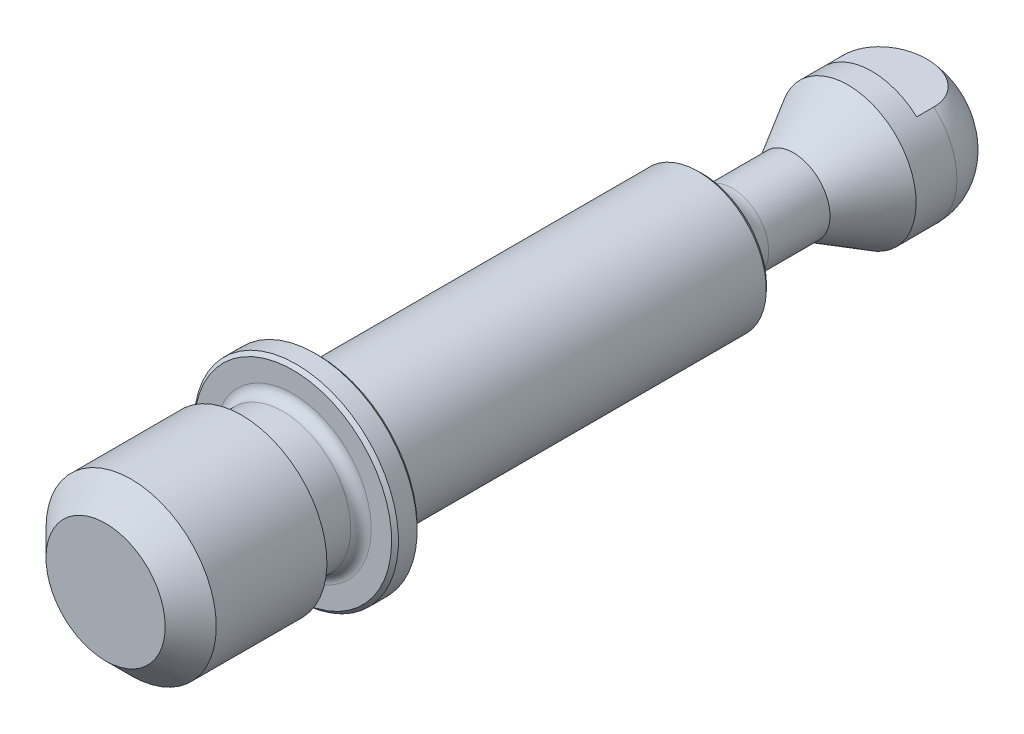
ISO-10303-21;
HEADER;
FILE_DESCRIPTION(('STEP AP214'),'2;1');
FILE_NAME('part.step','',(''),(''),'','','');
FILE_SCHEMA(('AUTOMOTIVE_DESIGN { 1 0 10303 214 1 1 1 1 }'));
ENDSEC;
DATA;
#1=APPLICATION_CONTEXT('core data for automotive mechanical design processes');
#2=APPLICATION_PROTOCOL_DEFINITION('international standard','automotive_design',2000,#1);
#3=PRODUCT_CONTEXT('',#1,'mechanical');
#4=PRODUCT('Part','Part','',(#3));
#5=PRODUCT_RELATED_PRODUCT_CATEGORY('part','',(#4));
#6=PRODUCT_DEFINITION_FORMATION('','',#4);
#7=PRODUCT_DEFINITION_CONTEXT('part definition',#1,'design');
#8=PRODUCT_DEFINITION('design','',#6,#7);
#9=PRODUCT_DEFINITION_SHAPE('','',#8);
#10=(LENGTH_UNIT() NAMED_UNIT(*) SI_UNIT(.MILLI.,.METRE.));
#11=(NAMED_UNIT(*) PLANE_ANGLE_UNIT() SI_UNIT($,.RADIAN.));
#12=(NAMED_UNIT(*) SI_UNIT($,.STERADIAN.) SOLID_ANGLE_UNIT());
#13=UNCERTAINTY_MEASURE_WITH_UNIT(LENGTH_MEASURE(1.E-05),#10,'distance_accuracy_value','');
#14=(GEOMETRIC_REPRESENTATION_CONTEXT(3) GLOBAL_UNCERTAINTY_ASSIGNED_CONTEXT((#13)) GLOBAL_UNIT_ASSIGNED_CONTEXT((#10,
#11,#12)) REPRESENTATION_CONTEXT('',''));
#15=CARTESIAN_POINT('',(0.,0.,0.));
#16=DIRECTION('',(0.,0.,1.));
#17=DIRECTION('',(1.,0.,0.));
#18=AXIS2_PLACEMENT_3D('',#15,#16,#17);
#19=CARTESIAN_POINT('',(0.,0.,0.));
#20=DIRECTION('',(0.,0.,1.));
#21=DIRECTION('',(0.,1.,0.));
#22=AXIS2_PLACEMENT_3D('',#19,#20,#21);
#23=CYLINDRICAL_SURFACE('',#22,6.);
#24=CARTESIAN_POINT('',(0.,0.,-0.2));
#25=DIRECTION('',(0.,0.,-1.));
#26=DIRECTION('',(0.,-1.,0.));
#27=AXIS2_PLACEMENT_3D('',#24,#25,#26);
#28=CIRCLE('',#27,6.);
#29=CARTESIAN_POINT('',(0.,-6.,-0.2));
#30=VERTEX_POINT('',#29);
#31=EDGE_CURVE('E22',#30,#30,#28,.T.);
#32=ORIENTED_EDGE('',*,*,#31,.T.);
#33=EDGE_LOOP('',(#32));
#34=FACE_BOUND('',#33,.T.);
#35=CARTESIAN_POINT('',(0.,0.,-1.3));
#36=DIRECTION('',(0.,0.,1.));
#37=DIRECTION('',(0.,1.,0.));
#38=AXIS2_PLACEMENT_3D('',#35,#36,#37);
#39=CIRCLE('',#38,6.);
#40=CARTESIAN_POINT('',(0.,6.,-1.3));
#41=VERTEX_POINT('',#40);
#42=EDGE_CURVE('E225',#41,#41,#39,.T.);
#43=ORIENTED_EDGE('',*,*,#42,.T.);
#44=EDGE_LOOP('',(#43));
#45=FACE_BOUND('',#44,.T.);
#46=ADVANCED_FACE('F14',(#34,#45),#23,.T.);
#47=CARTESIAN_POINT('',(-6.,0.,-1.5));
#48=DIRECTION('',(0.,0.,1.));
#49=DIRECTION('',(0.,1.,0.));
#50=AXIS2_PLACEMENT_3D('',#47,#48,#49);
#51=PLANE('',#50);
#52=CARTESIAN_POINT('',(0.,0.,-1.5));
#53=DIRECTION('',(0.,0.,1.));
#54=DIRECTION('',(0.,1.,0.));
#55=AXIS2_PLACEMENT_3D('',#52,#53,#54);
#56=CIRCLE('',#55,5.8);
#57=CARTESIAN_POINT('',(0.,5.8,-1.5));
#58=VERTEX_POINT('',#57);
#59=EDGE_CURVE('E9',#58,#58,#56,.F.);
#60=ORIENTED_EDGE('',*,*,#59,.T.);
#61=EDGE_LOOP('',(#60));
#62=FACE_BOUND('',#61,.T.);
#63=CARTESIAN_POINT('',(0.,0.,-1.5));
#64=DIRECTION('',(0.,0.,1.));
#65=DIRECTION('',(0.,1.,0.));
#66=AXIS2_PLACEMENT_3D('',#63,#64,#65);
#67=CIRCLE('',#66,4.4);
#68=CARTESIAN_POINT('',(0.,4.4,-1.5));
#69=VERTEX_POINT('',#68);
#70=EDGE_CURVE('E110',#69,#69,#67,.T.);
#71=ORIENTED_EDGE('',*,*,#70,.T.);
#72=EDGE_LOOP('',(#71));
#73=FACE_BOUND('',#72,.T.);
#74=ADVANCED_FACE('F182',(#62,#73),#51,.F.);
#75=CARTESIAN_POINT('',(0.,0.,0.));
#76=DIRECTION('',(0.,0.,1.));
#77=DIRECTION('',(0.,1.,0.));
#78=AXIS2_PLACEMENT_3D('',#75,#76,#77);
#79=CYLINDRICAL_SURFACE('',#78,4.);
#80=CARTESIAN_POINT('',(0.,0.,-23.8056329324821));
#81=DIRECTION('',(0.,0.,1.));
#82=DIRECTION('',(0.,1.,0.));
#83=AXIS2_PLACEMENT_3D('',#80,#81,#82);
#84=CIRCLE('',#83,4.);
#85=CARTESIAN_POINT('',(0.,4.,-23.8056329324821));
#86=VERTEX_POINT('',#85);
#87=EDGE_CURVE('E61',#86,#86,#84,.T.);
#88=ORIENTED_EDGE('',*,*,#87,.T.);
#89=EDGE_LOOP('',(#88));
#90=FACE_BOUND('',#89,.T.);
#91=CARTESIAN_POINT('',(0.,0.,-1.9));
#92=DIRECTION('',(0.,0.,1.));
#93=DIRECTION('',(0.,1.,0.));
#94=AXIS2_PLACEMENT_3D('',#91,#92,#93);
#95=CIRCLE('',#94,4.);
#96=CARTESIAN_POINT('',(0.,4.,-1.9));
#97=VERTEX_POINT('',#96);
#98=EDGE_CURVE('E113',#97,#97,#95,.F.);
#99=ORIENTED_EDGE('',*,*,#98,.T.);
#100=EDGE_LOOP('',(#99));
#101=FACE_BOUND('',#100,.T.);
#102=ADVANCED_FACE('F178',(#90,#101),#79,.T.);
#103=CARTESIAN_POINT('',(0.,0.,0.));
#104=DIRECTION('',(0.,0.,1.));
#105=DIRECTION('',(0.,1.,0.));
#106=AXIS2_PLACEMENT_3D('',#103,#104,#105);
#107=CYLINDRICAL_SURFACE('',#106,2.15);
#108=CARTESIAN_POINT('',(0.,0.,-25.8));
#109=DIRECTION('',(0.,0.,1.));
#110=DIRECTION('',(0.,1.,0.));
#111=AXIS2_PLACEMENT_3D('',#108,#109,#110);
#112=CIRCLE('',#111,2.15);
#113=CARTESIAN_POINT('',(0.,2.15,-25.8));
#114=VERTEX_POINT('',#113);
#115=EDGE_CURVE('E116',#114,#114,#112,.F.);
#116=ORIENTED_EDGE('',*,*,#115,.T.);
#117=EDGE_LOOP('',(#116));
#118=FACE_BOUND('',#117,.T.);
#119=CARTESIAN_POINT('',(0.,0.,-29.4));
#120=DIRECTION('',(0.,0.,1.));
#121=DIRECTION('',(0.,1.,0.));
#122=AXIS2_PLACEMENT_3D('',#119,#120,#121);
#123=CIRCLE('',#122,2.15);
#124=CARTESIAN_POINT('',(0.,2.15,-29.4));
#125=VERTEX_POINT('',#124);
#126=EDGE_CURVE('E89',#125,#125,#123,.T.);
#127=ORIENTED_EDGE('',*,*,#126,.T.);
#128=EDGE_LOOP('',(#127));
#129=FACE_BOUND('',#128,.T.);
#130=ADVANCED_FACE('F174',(#118,#129),#107,.T.);
#131=CARTESIAN_POINT('',(0.,0.,-32.6042939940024));
#132=DIRECTION('',(0.,0.,-1.));
#133=DIRECTION('',(0.,-1.,0.));
#134=AXIS2_PLACEMENT_3D('',#131,#132,#133);
#135=CONICAL_SURFACE('',#134,4.,0.523598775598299);
#136=ORIENTED_EDGE('',*,*,#126,.F.);
#137=EDGE_LOOP('',(#136));
#138=FACE_BOUND('',#137,.T.);
#139=CARTESIAN_POINT('',(0.,0.,-32.6042939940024));
#140=DIRECTION('',(0.,0.,1.));
#141=DIRECTION('',(0.,1.,0.));
#142=AXIS2_PLACEMENT_3D('',#139,#140,#141);
#143=CIRCLE('',#142,4.);
#144=CARTESIAN_POINT('',(0.,4.,-32.6042939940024));
#145=VERTEX_POINT('',#144);
#146=EDGE_CURVE('E86',#145,#145,#143,.T.);
#147=ORIENTED_EDGE('',*,*,#146,.T.);
#148=EDGE_LOOP('',(#147));
#149=FACE_BOUND('',#148,.T.);
#150=ADVANCED_FACE('F171',(#138,#149),#135,.T.);
#151=CARTESIAN_POINT('',(0.,0.,0.));
#152=DIRECTION('',(0.,0.,1.));
#153=DIRECTION('',(0.,1.,0.));
#154=AXIS2_PLACEMENT_3D('',#151,#152,#153);
#155=CYLINDRICAL_SURFACE('',#154,4.);
#156=CARTESIAN_POINT('',(0.,0.,-35.));
#157=DIRECTION('',(0.,0.,1.));
#158=DIRECTION('',(0.,1.,0.));
#159=AXIS2_PLACEMENT_3D('',#156,#157,#158);
#160=CIRCLE('',#159,4.);
#161=CARTESIAN_POINT('',(-2.6457513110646,3.,-35.));
#162=VERTEX_POINT('',#161);
#163=CARTESIAN_POINT('',(-2.6457513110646,-3.,-35.));
#164=VERTEX_POINT('',#163);
#165=EDGE_CURVE('E72',#162,#164,#160,.T.);
#166=ORIENTED_EDGE('',*,*,#165,.T.);
#167=DIRECTION('',(0.,0.,1.));
#168=VECTOR('',#167,1.);
#169=CARTESIAN_POINT('',(-2.6457513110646,-3.,0.));
#170=LINE('',#169,#168);
#171=CARTESIAN_POINT('',(-2.6457513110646,-3.,-34.));
#172=VERTEX_POINT('',#171);
#173=EDGE_CURVE('E29',#164,#172,#170,.T.);
#174=ORIENTED_EDGE('',*,*,#173,.T.);
#175=CARTESIAN_POINT('',(0.,0.,-34.));
#176=DIRECTION('',(0.,0.,-1.));
#177=DIRECTION('',(0.,-1.,0.));
#178=AXIS2_PLACEMENT_3D('',#175,#176,#177);
#179=CIRCLE('',#178,4.);
#180=CARTESIAN_POINT('',(2.6457513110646,-3.,-34.));
#181=VERTEX_POINT('',#180);
#182=EDGE_CURVE('E58',#181,#172,#179,.T.);
#183=ORIENTED_EDGE('',*,*,#182,.F.);
#184=DIRECTION('',(0.,0.,1.));
#185=VECTOR('',#184,1.);
#186=CARTESIAN_POINT('',(2.6457513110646,-3.,0.));
#187=LINE('',#186,#185);
#188=CARTESIAN_POINT('',(2.6457513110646,-3.,-35.));
#189=VERTEX_POINT('',#188);
#190=EDGE_CURVE('E65',#181,#189,#187,.F.);
#191=ORIENTED_EDGE('',*,*,#190,.T.);
#192=CARTESIAN_POINT('',(2.6457513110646,3.,-35.));
#193=VERTEX_POINT('',#192);
#194=EDGE_CURVE('E37',#189,#193,#160,.T.);
#195=ORIENTED_EDGE('',*,*,#194,.T.);
#196=DIRECTION('',(0.,0.,1.));
#197=VECTOR('',#196,1.);
#198=CARTESIAN_POINT('',(2.6457513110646,3.,0.));
#199=LINE('',#198,#197);
#200=CARTESIAN_POINT('',(2.6457513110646,3.,-34.));
#201=VERTEX_POINT('',#200);
#202=EDGE_CURVE('E81',#193,#201,#199,.T.);
#203=ORIENTED_EDGE('',*,*,#202,.T.);
#204=CARTESIAN_POINT('',(0.,0.,-34.));
#205=DIRECTION('',(0.,0.,-1.));
#206=DIRECTION('',(0.,-1.,0.));
#207=AXIS2_PLACEMENT_3D('',#204,#205,#206);
#208=CIRCLE('',#207,4.);
#209=CARTESIAN_POINT('',(-2.6457513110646,3.,-34.));
#210=VERTEX_POINT('',#209);
#211=EDGE_CURVE('E130',#210,#201,#208,.T.);
#212=ORIENTED_EDGE('',*,*,#211,.F.);
#213=DIRECTION('',(0.,0.,1.));
#214=VECTOR('',#213,1.);
#215=CARTESIAN_POINT('',(-2.6457513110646,3.,0.));
#216=LINE('',#215,#214);
#217=EDGE_CURVE('E76',#210,#162,#216,.F.);
#218=ORIENTED_EDGE('',*,*,#217,.T.);
#219=EDGE_LOOP('',(#166,#174,#183,#191,#195,#203,#212,#218));
#220=FACE_BOUND('',#219,.T.);
#221=ORIENTED_EDGE('',*,*,#146,.F.);
#222=EDGE_LOOP('',(#221));
#223=FACE_BOUND('',#222,.T.);
#224=ADVANCED_FACE('F68',(#220,#223),#155,.T.);
#225=CARTESIAN_POINT('',(0.,0.,-38.));
#226=DIRECTION('',(0.,0.,1.));
#227=DIRECTION('',(0.,1.,0.));
#228=AXIS2_PLACEMENT_3D('',#225,#226,#227);
#229=PLANE('',#228);
#230=CARTESIAN_POINT('',(0.,0.,-38.));
#231=DIRECTION('',(0.,0.,1.));
#232=DIRECTION('',(0.,1.,0.));
#233=AXIS2_PLACEMENT_3D('',#230,#231,#232);
#234=CIRCLE('',#233,1.);
#235=CARTESIAN_POINT('',(0.,1.,-38.));
#236=VERTEX_POINT('',#235);
#237=EDGE_CURVE('E120',#236,#236,#234,.F.);
#238=ORIENTED_EDGE('',*,*,#237,.T.);
#239=EDGE_LOOP('',(#238));
#240=FACE_BOUND('',#239,.T.);
#241=ADVANCED_FACE('F164',(#240),#229,.F.);
#242=CARTESIAN_POINT('',(-5.,0.,11.));
#243=DIRECTION('',(0.,0.,-1.));
#244=DIRECTION('',(0.,-1.,0.));
#245=AXIS2_PLACEMENT_3D('',#242,#243,#244);
#246=PLANE('',#245);
#247=CARTESIAN_POINT('',(0.,0.,11.));
#248=DIRECTION('',(0.,0.,-1.));
#249=DIRECTION('',(0.,-1.,0.));
#250=AXIS2_PLACEMENT_3D('',#247,#248,#249);
#251=CIRCLE('',#250,3.5);
#252=CARTESIAN_POINT('',(0.,-3.5,11.));
#253=VERTEX_POINT('',#252);
#254=EDGE_CURVE('E92',#253,#253,#251,.F.);
#255=ORIENTED_EDGE('',*,*,#254,.T.);
#256=EDGE_LOOP('',(#255));
#257=FACE_BOUND('',#256,.T.);
#258=ADVANCED_FACE('F160',(#257),#246,.F.);
#259=CARTESIAN_POINT('',(0.,0.,0.));
#260=DIRECTION('',(0.,0.,1.));
#261=DIRECTION('',(0.,1.,0.));
#262=AXIS2_PLACEMENT_3D('',#259,#260,#261);
#263=CYLINDRICAL_SURFACE('',#262,5.);
#264=CARTESIAN_POINT('',(0.,0.,9.5));
#265=DIRECTION('',(0.,0.,-1.));
#266=DIRECTION('',(0.,-1.,0.));
#267=AXIS2_PLACEMENT_3D('',#264,#265,#266);
#268=CIRCLE('',#267,5.);
#269=CARTESIAN_POINT('',(0.,-5.,9.5));
#270=VERTEX_POINT('',#269);
#271=EDGE_CURVE('E95',#270,#270,#268,.T.);
#272=ORIENTED_EDGE('',*,*,#271,.T.);
#273=EDGE_LOOP('',(#272));
#274=FACE_BOUND('',#273,.T.);
#275=CARTESIAN_POINT('',(0.,0.,3.));
#276=DIRECTION('',(0.,0.,1.));
#277=DIRECTION('',(0.,1.,0.));
#278=AXIS2_PLACEMENT_3D('',#275,#276,#277);
#279=CIRCLE('',#278,5.);
#280=CARTESIAN_POINT('',(0.,5.,3.));
#281=VERTEX_POINT('',#280);
#282=EDGE_CURVE('E83',#281,#281,#279,.T.);
#283=ORIENTED_EDGE('',*,*,#282,.T.);
#284=EDGE_LOOP('',(#283));
#285=FACE_BOUND('',#284,.T.);
#286=ADVANCED_FACE('F156',(#274,#285),#263,.T.);
#287=CARTESIAN_POINT('',(-4.,0.,3.));
#288=DIRECTION('',(0.,0.,1.));
#289=DIRECTION('',(0.,1.,0.));
#290=AXIS2_PLACEMENT_3D('',#287,#288,#289);
#291=PLANE('',#290);
#292=CARTESIAN_POINT('',(0.,0.,3.));
#293=DIRECTION('',(0.,0.,1.));
#294=DIRECTION('',(0.,1.,0.));
#295=AXIS2_PLACEMENT_3D('',#292,#293,#294);
#296=CIRCLE('',#295,4.6);
#297=CARTESIAN_POINT('',(0.,4.6,3.));
#298=VERTEX_POINT('',#297);
#299=EDGE_CURVE('E98',#298,#298,#296,.T.);
#300=ORIENTED_EDGE('',*,*,#299,.T.);
#301=EDGE_LOOP('',(#300));
#302=FACE_BOUND('',#301,.T.);
#303=ORIENTED_EDGE('',*,*,#282,.F.);
#304=EDGE_LOOP('',(#303));
#305=FACE_BOUND('',#304,.T.);
#306=ADVANCED_FACE('F152',(#302,#305),#291,.F.);
#307=CARTESIAN_POINT('',(0.,0.,0.));
#308=DIRECTION('',(0.,0.,1.));
#309=DIRECTION('',(0.,1.,0.));
#310=AXIS2_PLACEMENT_3D('',#307,#308,#309);
#311=CYLINDRICAL_SURFACE('',#310,4.);
#312=CARTESIAN_POINT('',(0.,0.,2.4));
#313=DIRECTION('',(0.,0.,1.));
#314=DIRECTION('',(0.,1.,0.));
#315=AXIS2_PLACEMENT_3D('',#312,#313,#314);
#316=CIRCLE('',#315,4.);
#317=CARTESIAN_POINT('',(0.,4.,2.4));
#318=VERTEX_POINT('',#317);
#319=EDGE_CURVE('E104',#318,#318,#316,.F.);
#320=ORIENTED_EDGE('',*,*,#319,.T.);
#321=EDGE_LOOP('',(#320));
#322=FACE_BOUND('',#321,.T.);
#323=CARTESIAN_POINT('',(0.,0.,0.6));
#324=DIRECTION('',(0.,0.,-1.));
#325=DIRECTION('',(0.,-1.,0.));
#326=AXIS2_PLACEMENT_3D('',#323,#324,#325);
#327=CIRCLE('',#326,4.);
#328=CARTESIAN_POINT('',(0.,-4.,0.6));
#329=VERTEX_POINT('',#328);
#330=EDGE_CURVE('E101',#329,#329,#327,.F.);
#331=ORIENTED_EDGE('',*,*,#330,.T.);
#332=EDGE_LOOP('',(#331));
#333=FACE_BOUND('',#332,.T.);
#334=ADVANCED_FACE('F148',(#322,#333),#311,.T.);
#335=CARTESIAN_POINT('',(-4.,0.,0.));
#336=DIRECTION('',(0.,0.,-1.));
#337=DIRECTION('',(0.,-1.,0.));
#338=AXIS2_PLACEMENT_3D('',#335,#336,#337);
#339=PLANE('',#338);
#340=CARTESIAN_POINT('',(0.,0.,0.));
#341=DIRECTION('',(0.,0.,-1.));
#342=DIRECTION('',(0.,-1.,0.));
#343=AXIS2_PLACEMENT_3D('',#340,#341,#342);
#344=CIRCLE('',#343,5.8);
#345=CARTESIAN_POINT('',(0.,-5.8,0.));
#346=VERTEX_POINT('',#345);
#347=EDGE_CURVE('E222',#346,#346,#344,.F.);
#348=ORIENTED_EDGE('',*,*,#347,.T.);
#349=EDGE_LOOP('',(#348));
#350=FACE_BOUND('',#349,.T.);
#351=CARTESIAN_POINT('',(0.,0.,0.));
#352=DIRECTION('',(0.,0.,-1.));
#353=DIRECTION('',(0.,-1.,0.));
#354=AXIS2_PLACEMENT_3D('',#351,#352,#353);
#355=CIRCLE('',#354,4.6);
#356=CARTESIAN_POINT('',(0.,-4.6,0.));
#357=VERTEX_POINT('',#356);
#358=EDGE_CURVE('E107',#357,#357,#355,.T.);
#359=ORIENTED_EDGE('',*,*,#358,.T.);
#360=EDGE_LOOP('',(#359));
#361=FACE_BOUND('',#360,.T.);
#362=ADVANCED_FACE('F144',(#350,#361),#339,.F.);
#363=CARTESIAN_POINT('',(0.,0.,11.));
#364=DIRECTION('',(0.,0.,-1.));
#365=DIRECTION('',(0.,-1.,0.));
#366=AXIS2_PLACEMENT_3D('',#363,#364,#365);
#367=CONICAL_SURFACE('',#366,3.5,0.785398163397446);
#368=ORIENTED_EDGE('',*,*,#271,.F.);
#369=EDGE_LOOP('',(#368));
#370=FACE_BOUND('',#369,.T.);
#371=ORIENTED_EDGE('',*,*,#254,.F.);
#372=EDGE_LOOP('',(#371));
#373=FACE_BOUND('',#372,.T.);
#374=ADVANCED_FACE('F147',(#370,#373),#367,.T.);
#375=CARTESIAN_POINT('',(0.,0.,2.4));
#376=DIRECTION('',(0.,0.,1.));
#377=DIRECTION('',(0.,1.,0.));
#378=AXIS2_PLACEMENT_3D('',#375,#376,#377);
#379=TOROIDAL_SURFACE('',#378,4.6,0.6);
#380=ORIENTED_EDGE('',*,*,#319,.F.);
#381=EDGE_LOOP('',(#380));
#382=FACE_BOUND('',#381,.T.);
#383=ORIENTED_EDGE('',*,*,#299,.F.);
#384=EDGE_LOOP('',(#383));
#385=FACE_BOUND('',#384,.T.);
#386=ADVANCED_FACE('F192',(#382,#385),#379,.F.);
#387=CARTESIAN_POINT('',(0.,0.,0.6));
#388=DIRECTION('',(0.,0.,-1.));
#389=DIRECTION('',(0.,-1.,0.));
#390=AXIS2_PLACEMENT_3D('',#387,#388,#389);
#391=TOROIDAL_SURFACE('',#390,4.6,0.6);
#392=ORIENTED_EDGE('',*,*,#358,.F.);
#393=EDGE_LOOP('',(#392));
#394=FACE_BOUND('',#393,.T.);
#395=ORIENTED_EDGE('',*,*,#330,.F.);
#396=EDGE_LOOP('',(#395));
#397=FACE_BOUND('',#396,.T.);
#398=ADVANCED_FACE('F196',(#394,#397),#391,.F.);
#399=CARTESIAN_POINT('',(0.,0.,-1.9));
#400=DIRECTION('',(0.,0.,1.));
#401=DIRECTION('',(0.,1.,0.));
#402=AXIS2_PLACEMENT_3D('',#399,#400,#401);
#403=TOROIDAL_SURFACE('',#402,4.4,0.4);
#404=ORIENTED_EDGE('',*,*,#98,.F.);
#405=EDGE_LOOP('',(#404));
#406=FACE_BOUND('',#405,.T.);
#407=ORIENTED_EDGE('',*,*,#70,.F.);
#408=EDGE_LOOP('',(#407));
#409=FACE_BOUND('',#408,.T.);
#410=ADVANCED_FACE('F200',(#406,#409),#403,.F.);
#411=CARTESIAN_POINT('',(0.,0.,-25.8));
#412=DIRECTION('',(0.,0.,1.));
#413=DIRECTION('',(0.,1.,0.));
#414=AXIS2_PLACEMENT_3D('',#411,#412,#413);
#415=TOROIDAL_SURFACE('',#414,3.95,1.8);
#416=CARTESIAN_POINT('',(0.,0.,-24.0050696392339));
#417=DIRECTION('',(0.,0.,-1.));
#418=DIRECTION('',(0.,-1.,0.));
#419=AXIS2_PLACEMENT_3D('',#416,#417,#418);
#420=CIRCLE('',#419,3.815);
#421=CARTESIAN_POINT('',(0.,-3.815,-24.0050696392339));
#422=VERTEX_POINT('',#421);
#423=EDGE_CURVE('E215',#422,#422,#420,.T.);
#424=ORIENTED_EDGE('',*,*,#423,.T.);
#425=EDGE_LOOP('',(#424));
#426=FACE_BOUND('',#425,.T.);
#427=ORIENTED_EDGE('',*,*,#115,.F.);
#428=EDGE_LOOP('',(#427));
#429=FACE_BOUND('',#428,.T.);
#430=ADVANCED_FACE('F203',(#426,#429),#415,.F.);
#431=CARTESIAN_POINT('',(0.,0.,-35.));
#432=DIRECTION('',(0.,0.,1.));
#433=DIRECTION('',(0.,1.,0.));
#434=AXIS2_PLACEMENT_3D('',#431,#432,#433);
#435=DEGENERATE_TOROIDAL_SURFACE('',#434,1.,3.,.T.);
#436=CARTESIAN_POINT('',(0.,-3.,-37.2360679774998));
#437=CARTESIAN_POINT('',(0.182130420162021,-3.,-37.2360730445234));
#438=CARTESIAN_POINT('',(0.364315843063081,-3.,-37.2213187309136));
#439=CARTESIAN_POINT('',(0.723592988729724,-3.,-37.1613493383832));
#440=CARTESIAN_POINT('',(0.900689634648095,-3.,-37.1161648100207));
#441=CARTESIAN_POINT('',(1.20801765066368,-3.,-37.0061514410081));
#442=CARTESIAN_POINT('',(1.3403812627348,-3.,-36.9472966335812));
#443=CARTESIAN_POINT('',(1.59371415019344,-3.,-36.8086382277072));
#444=CARTESIAN_POINT('',(1.71469026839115,-3.,-36.7288473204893));
#445=CARTESIAN_POINT('',(1.94131475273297,-3.,-36.548058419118));
#446=CARTESIAN_POINT('',(2.04683753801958,-3.,-36.4469014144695));
#447=CARTESIAN_POINT('',(2.23610882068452,-3.,-36.2258543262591));
#448=CARTESIAN_POINT('',(2.31987165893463,-3.,-36.1059766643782));
#449=CARTESIAN_POINT('',(2.45137620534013,-3.,-35.8685696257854));
#450=CARTESIAN_POINT('',(2.50243931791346,-3.,-35.7528750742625));
#451=CARTESIAN_POINT('',(2.58222641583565,-3.,-35.5140328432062));
#452=CARTESIAN_POINT('',(2.61096503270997,-3.,-35.3908901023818));
#453=CARTESIAN_POINT('',(2.64317885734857,-3.,-35.1526642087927));
#454=CARTESIAN_POINT('',(2.64869439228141,-3.,-35.0378527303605));
#455=CARTESIAN_POINT('',(2.6398528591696,-3.,-34.8090131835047));
#456=CARTESIAN_POINT('',(2.62550060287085,-3.,-34.6949849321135));
#457=CARTESIAN_POINT('',(2.57811323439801,-3.,-34.4737675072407));
#458=CARTESIAN_POINT('',(2.54553396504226,-3.,-34.366479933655));
#459=CARTESIAN_POINT('',(2.4633087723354,-3.,-34.158681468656));
#460=CARTESIAN_POINT('',(2.41366206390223,-3.,-34.0581708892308));
#461=CARTESIAN_POINT('',(2.29748673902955,-3.,-33.8635303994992));
#462=CARTESIAN_POINT('',(2.23051545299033,-3.,-33.769665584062));
#463=CARTESIAN_POINT('',(2.08284770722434,-3.,-33.5934794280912));
#464=CARTESIAN_POINT('',(2.00214781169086,-3.,-33.5111609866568));
#465=CARTESIAN_POINT('',(1.82264615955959,-3.,-33.3531312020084));
#466=CARTESIAN_POINT('',(1.72291044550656,-3.,-33.2784840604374));
#467=CARTESIAN_POINT('',(1.51360451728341,-3.,-33.1446444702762));
#468=CARTESIAN_POINT('',(1.40403016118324,-3.,-33.0854585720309));
#469=CARTESIAN_POINT('',(1.16220414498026,-3.,-32.9752876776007));
#470=CARTESIAN_POINT('',(1.02891680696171,-3.,-32.9265841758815));
#471=CARTESIAN_POINT('',(0.756854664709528,-3.,-32.8483168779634));
#472=CARTESIAN_POINT('',(0.61807602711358,-3.,-32.8187667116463));
#473=CARTESIAN_POINT('',(0.311732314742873,-3.,-32.7741468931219));
#474=CARTESIAN_POINT('',(0.143620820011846,-3.,-32.7628003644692));
#475=CARTESIAN_POINT('',(-0.192610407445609,-3.,-32.7652425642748));
#476=CARTESIAN_POINT('',(-0.360729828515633,-3.,-32.7790661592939));
#477=CARTESIAN_POINT('',(-0.711775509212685,-3.,-32.8356870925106));
#478=CARTESIAN_POINT('',(-0.894221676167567,-3.,-32.8815892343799));
#479=CARTESIAN_POINT('',(-1.2467838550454,-3.,-33.0076571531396));
#480=CARTESIAN_POINT('',(-1.41692949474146,-3.,-33.0877371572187));
#481=CARTESIAN_POINT('',(-1.68782709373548,-3.,-33.253590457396));
#482=CARTESIAN_POINT('',(-1.79407437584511,-3.,-33.3304326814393));
#483=CARTESIAN_POINT('',(-1.99244199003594,-3.,-33.5006681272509));
#484=CARTESIAN_POINT('',(-2.08456939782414,-3.,-33.5940530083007));
#485=CARTESIAN_POINT('',(-2.25136410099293,-3.,-33.796238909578));
#486=CARTESIAN_POINT('',(-2.32593419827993,-3.,-33.9051206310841));
#487=CARTESIAN_POINT('',(-2.45340856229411,-3.,-34.1349484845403));
#488=CARTESIAN_POINT('',(-2.50632050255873,-3.,-34.2558903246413));
#489=CARTESIAN_POINT('',(-2.58380733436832,-3.,-34.4936035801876));
#490=CARTESIAN_POINT('',(-2.61062950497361,-3.,-34.6096453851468));
#491=CARTESIAN_POINT('',(-2.64319909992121,-3.,-34.8446356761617));
#492=CARTESIAN_POINT('',(-2.648955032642,-3.,-34.9635829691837));
#493=CARTESIAN_POINT('',(-2.6394119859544,-3.,-35.1942716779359));
#494=CARTESIAN_POINT('',(-2.6252141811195,-3.,-35.3060605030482));
#495=CARTESIAN_POINT('',(-2.57829739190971,-3.,-35.525661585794));
#496=CARTESIAN_POINT('',(-2.54557999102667,-3.,-35.63347418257));
#497=CARTESIAN_POINT('',(-2.46277618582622,-3.,-35.8425934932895));
#498=CARTESIAN_POINT('',(-2.41263246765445,-3.,-35.9438774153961));
#499=CARTESIAN_POINT('',(-2.29688023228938,-3.,-36.1371530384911));
#500=CARTESIAN_POINT('',(-2.23126933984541,-3.,-36.229143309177));
#501=CARTESIAN_POINT('',(-2.08293087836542,-3.,-36.4067191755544));
#502=CARTESIAN_POINT('',(-1.99947023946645,-3.,-36.4916905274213));
#503=CARTESIAN_POINT('',(-1.82071046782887,-3.,-36.6480453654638));
#504=CARTESIAN_POINT('',(-1.72540724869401,-3.,-36.7194241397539));
#505=CARTESIAN_POINT('',(-1.51485660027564,-3.,-36.8550675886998));
#506=CARTESIAN_POINT('',(-1.39856751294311,-3.,-36.9177097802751));
#507=CARTESIAN_POINT('',(-1.15828317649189,-3.,-37.0257432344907));
#508=CARTESIAN_POINT('',(-1.03428427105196,-3.,-37.0711262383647));
#509=CARTESIAN_POINT('',(-0.760833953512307,-3.,-37.1513162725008));
#510=CARTESIAN_POINT('',(-0.610526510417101,-3.,-37.1831966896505));
#511=CARTESIAN_POINT('',(-0.306828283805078,-3.,-37.2255846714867));
#512=CARTESIAN_POINT('',(-0.153433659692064,-3.,-37.2360637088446));
#513=CARTESIAN_POINT('',(0.,-3.,-37.2360679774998));
#514=B_SPLINE_CURVE_WITH_KNOTS('',3,(#436,#437,#438,#439,#440,#441,#442,#443,#444,#445,#446,
#447,#448,#449,#450,#451,#452,#453,#454,#455,#456,#457,#458,#459,#460,#461,#462,#463,#464,#465,
#466,#467,#468,#469,#470,#471,#472,#473,#474,#475,#476,#477,#478,#479,#480,#481,#482,#483,#484,
#485,#486,#487,#488,#489,#490,#491,#492,#493,#494,#495,#496,#497,#498,#499,#500,#501,#502,#503,
#504,#505,#506,#507,#508,#509,#510,#511,#512,#513),.UNSPECIFIED.,.T.,.F.,(4,2,2,2,2,2,2,2,2,2,2,
2,2,2,2,2,2,2,2,2,2,2,2,2,2,2,2,2,2,2,2,2,2,2,2,2,2,2,4),(0.,0.545881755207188,1.09121628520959,
1.52407148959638,1.95666490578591,2.39259896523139,2.82824498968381,3.20555876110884,
3.58262503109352,3.9257665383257,4.2688249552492,4.60366436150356,4.93851917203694,
5.28296170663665,5.62749057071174,5.99973468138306,6.37213624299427,6.79627198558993,
7.22070922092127,7.72421554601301,8.22841987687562,8.78974139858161,9.34966243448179,
9.74144173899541,10.1330240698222,10.5267257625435,10.9202878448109,11.2757520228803,
11.6310726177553,11.9675363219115,12.3039712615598,12.6415233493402,12.9791273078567,
13.3349649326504,13.6909256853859,14.0856703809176,14.4806037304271,14.9398637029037,
15.3997354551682),.UNSPECIFIED.);
#515=EDGE_CURVE('E62',#164,#189,#514,.T.);
#516=ORIENTED_EDGE('',*,*,#515,.F.);
#517=ORIENTED_EDGE('',*,*,#165,.F.);
#518=CARTESIAN_POINT('',(0.,3.,-37.2360679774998));
#519=CARTESIAN_POINT('',(-0.182130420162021,3.,-37.2360730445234));
#520=CARTESIAN_POINT('',(-0.364315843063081,3.,-37.2213187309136));
#521=CARTESIAN_POINT('',(-0.723592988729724,3.,-37.1613493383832));
#522=CARTESIAN_POINT('',(-0.900689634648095,3.,-37.1161648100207));
#523=CARTESIAN_POINT('',(-1.20801765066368,3.,-37.0061514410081));
#524=CARTESIAN_POINT('',(-1.3403812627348,3.,-36.9472966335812));
#525=CARTESIAN_POINT('',(-1.59371415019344,3.,-36.8086382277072));
#526=CARTESIAN_POINT('',(-1.71469026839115,3.,-36.7288473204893));
#527=CARTESIAN_POINT('',(-1.94131475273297,3.,-36.548058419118));
#528=CARTESIAN_POINT('',(-2.04683753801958,3.,-36.4469014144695));
#529=CARTESIAN_POINT('',(-2.23610882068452,3.,-36.2258543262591));
#530=CARTESIAN_POINT('',(-2.31987165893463,3.,-36.1059766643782));
#531=CARTESIAN_POINT('',(-2.45137620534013,3.,-35.8685696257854));
#532=CARTESIAN_POINT('',(-2.50243931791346,3.,-35.7528750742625));
#533=CARTESIAN_POINT('',(-2.58222641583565,3.,-35.5140328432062));
#534=CARTESIAN_POINT('',(-2.61096503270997,3.,-35.3908901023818));
#535=CARTESIAN_POINT('',(-2.64317885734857,3.,-35.1526642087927));
#536=CARTESIAN_POINT('',(-2.64869439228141,3.,-35.0378527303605));
#537=CARTESIAN_POINT('',(-2.6398528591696,3.,-34.8090131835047));
#538=CARTESIAN_POINT('',(-2.62550060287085,3.,-34.6949849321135));
#539=CARTESIAN_POINT('',(-2.57811323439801,3.,-34.4737675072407));
#540=CARTESIAN_POINT('',(-2.54553396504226,3.,-34.366479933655));
#541=CARTESIAN_POINT('',(-2.4633087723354,3.,-34.158681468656));
#542=CARTESIAN_POINT('',(-2.41366206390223,3.,-34.0581708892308));
#543=CARTESIAN_POINT('',(-2.29748673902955,3.,-33.8635303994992));
#544=CARTESIAN_POINT('',(-2.23051545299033,3.,-33.769665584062));
#545=CARTESIAN_POINT('',(-2.08284770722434,3.,-33.5934794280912));
#546=CARTESIAN_POINT('',(-2.00214781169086,3.,-33.5111609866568));
#547=CARTESIAN_POINT('',(-1.82264615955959,3.,-33.3531312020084));
#548=CARTESIAN_POINT('',(-1.72291044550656,3.,-33.2784840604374));
#549=CARTESIAN_POINT('',(-1.51360451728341,3.,-33.1446444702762));
#550=CARTESIAN_POINT('',(-1.40403016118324,3.,-33.0854585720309));
#551=CARTESIAN_POINT('',(-1.16220414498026,3.,-32.9752876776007));
#552=CARTESIAN_POINT('',(-1.02891680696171,3.,-32.9265841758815));
#553=CARTESIAN_POINT('',(-0.756854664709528,3.,-32.8483168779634));
#554=CARTESIAN_POINT('',(-0.61807602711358,3.,-32.8187667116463));
#555=CARTESIAN_POINT('',(-0.311732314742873,3.,-32.7741468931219));
#556=CARTESIAN_POINT('',(-0.143620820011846,3.,-32.7628003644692));
#557=CARTESIAN_POINT('',(0.192610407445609,3.,-32.7652425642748));
#558=CARTESIAN_POINT('',(0.360729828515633,3.,-32.7790661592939));
#559=CARTESIAN_POINT('',(0.711775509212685,3.,-32.8356870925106));
#560=CARTESIAN_POINT('',(0.894221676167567,3.,-32.8815892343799));
#561=CARTESIAN_POINT('',(1.2467838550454,3.,-33.0076571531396));
#562=CARTESIAN_POINT('',(1.41692949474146,3.,-33.0877371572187));
#563=CARTESIAN_POINT('',(1.68782709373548,3.,-33.253590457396));
#564=CARTESIAN_POINT('',(1.79407437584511,3.,-33.3304326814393));
#565=CARTESIAN_POINT('',(1.99244199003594,3.,-33.5006681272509));
#566=CARTESIAN_POINT('',(2.08456939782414,3.,-33.5940530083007));
#567=CARTESIAN_POINT('',(2.25136410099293,3.,-33.796238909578));
#568=CARTESIAN_POINT('',(2.32593419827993,3.,-33.9051206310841));
#569=CARTESIAN_POINT('',(2.45340856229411,3.,-34.1349484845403));
#570=CARTESIAN_POINT('',(2.50632050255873,3.,-34.2558903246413));
#571=CARTESIAN_POINT('',(2.58380733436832,3.,-34.4936035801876));
#572=CARTESIAN_POINT('',(2.61062950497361,3.,-34.6096453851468));
#573=CARTESIAN_POINT('',(2.64319909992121,3.,-34.8446356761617));
#574=CARTESIAN_POINT('',(2.648955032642,3.,-34.9635829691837));
#575=CARTESIAN_POINT('',(2.6394119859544,3.,-35.1942716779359));
#576=CARTESIAN_POINT('',(2.6252141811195,3.,-35.3060605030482));
#577=CARTESIAN_POINT('',(2.57829739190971,3.,-35.525661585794));
#578=CARTESIAN_POINT('',(2.54557999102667,3.,-35.63347418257));
#579=CARTESIAN_POINT('',(2.46277618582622,3.,-35.8425934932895));
#580=CARTESIAN_POINT('',(2.41263246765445,3.,-35.9438774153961));
#581=CARTESIAN_POINT('',(2.29688023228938,3.,-36.1371530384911));
#582=CARTESIAN_POINT('',(2.23126933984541,3.,-36.229143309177));
#583=CARTESIAN_POINT('',(2.08293087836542,3.,-36.4067191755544));
#584=CARTESIAN_POINT('',(1.99947023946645,3.,-36.4916905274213));
#585=CARTESIAN_POINT('',(1.82071046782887,3.,-36.6480453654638));
#586=CARTESIAN_POINT('',(1.72540724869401,3.,-36.7194241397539));
#587=CARTESIAN_POINT('',(1.51485660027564,3.,-36.8550675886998));
#588=CARTESIAN_POINT('',(1.39856751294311,3.,-36.9177097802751));
#589=CARTESIAN_POINT('',(1.15828317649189,3.,-37.0257432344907));
#590=CARTESIAN_POINT('',(1.03428427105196,3.,-37.0711262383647));
#591=CARTESIAN_POINT('',(0.760833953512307,3.,-37.1513162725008));
#592=CARTESIAN_POINT('',(0.610526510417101,3.,-37.1831966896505));
#593=CARTESIAN_POINT('',(0.306828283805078,3.,-37.2255846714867));
#594=CARTESIAN_POINT('',(0.153433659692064,3.,-37.2360637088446));
#595=CARTESIAN_POINT('',(0.,3.,-37.2360679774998));
#596=B_SPLINE_CURVE_WITH_KNOTS('',3,(#518,#519,#520,#521,#522,#523,#524,#525,#526,#527,#528,
#529,#530,#531,#532,#533,#534,#535,#536,#537,#538,#539,#540,#541,#542,#543,#544,#545,#546,#547,
#548,#549,#550,#551,#552,#553,#554,#555,#556,#557,#558,#559,#560,#561,#562,#563,#564,#565,#566,
#567,#568,#569,#570,#571,#572,#573,#574,#575,#576,#577,#578,#579,#580,#581,#582,#583,#584,#585,
#586,#587,#588,#589,#590,#591,#592,#593,#594,#595),.UNSPECIFIED.,.T.,.F.,(4,2,2,2,2,2,2,2,2,2,2,
2,2,2,2,2,2,2,2,2,2,2,2,2,2,2,2,2,2,2,2,2,2,2,2,2,2,2,4),(0.,0.545881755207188,1.09121628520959,
1.52407148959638,1.95666490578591,2.39259896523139,2.82824498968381,3.20555876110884,
3.58262503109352,3.9257665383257,4.2688249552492,4.60366436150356,4.93851917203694,
5.28296170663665,5.62749057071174,5.99973468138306,6.37213624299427,6.79627198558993,
7.22070922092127,7.72421554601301,8.22841987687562,8.78974139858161,9.34966243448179,
9.74144173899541,10.1330240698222,10.5267257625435,10.9202878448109,11.2757520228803,
11.6310726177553,11.9675363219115,12.3039712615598,12.6415233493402,12.9791273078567,
13.3349649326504,13.6909256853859,14.0856703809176,14.4806037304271,14.9398637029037,
15.3997354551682),.UNSPECIFIED.);
#597=EDGE_CURVE('E123',#193,#162,#596,.T.);
#598=ORIENTED_EDGE('',*,*,#597,.F.);
#599=ORIENTED_EDGE('',*,*,#194,.F.);
#600=EDGE_LOOP('',(#516,#517,#598,#599));
#601=FACE_BOUND('',#600,.T.);
#602=ORIENTED_EDGE('',*,*,#237,.F.);
#603=EDGE_LOOP('',(#602));
#604=FACE_BOUND('',#603,.T.);
#605=ADVANCED_FACE('F132',(#601,#604),#435,.T.);
#606=CARTESIAN_POINT('',(6.25,3.,-34.));
#607=DIRECTION('',(0.,0.,-1.));
#608=DIRECTION('',(0.,-1.,0.));
#609=AXIS2_PLACEMENT_3D('',#606,#607,#608);
#610=PLANE('',#609);
#611=ORIENTED_EDGE('',*,*,#211,.T.);
#612=DIRECTION('',(-1.,0.,0.));
#613=VECTOR('',#612,1.);
#614=CARTESIAN_POINT('',(6.25,3.,-34.));
#615=LINE('',#614,#613);
#616=EDGE_CURVE('E73',#201,#210,#615,.T.);
#617=ORIENTED_EDGE('',*,*,#616,.T.);
#618=EDGE_LOOP('',(#611,#617));
#619=FACE_BOUND('',#618,.T.);
#620=ADVANCED_FACE('F141',(#619),#610,.T.);
#621=CARTESIAN_POINT('',(6.25,3.,-34.));
#622=DIRECTION('',(0.,-1.,0.));
#623=DIRECTION('',(1.,0.,0.));
#624=AXIS2_PLACEMENT_3D('',#621,#622,#623);
#625=PLANE('',#624);
#626=ORIENTED_EDGE('',*,*,#597,.T.);
#627=ORIENTED_EDGE('',*,*,#217,.F.);
#628=ORIENTED_EDGE('',*,*,#616,.F.);
#629=ORIENTED_EDGE('',*,*,#202,.F.);
#630=EDGE_LOOP('',(#626,#627,#628,#629));
#631=FACE_BOUND('',#630,.T.);
#632=ADVANCED_FACE('F136',(#631),#625,.F.);
#633=CARTESIAN_POINT('',(-7.5,-5.5,-34.));
#634=DIRECTION('',(0.,0.,-1.));
#635=DIRECTION('',(0.,-1.,0.));
#636=AXIS2_PLACEMENT_3D('',#633,#634,#635);
#637=PLANE('',#636);
#638=ORIENTED_EDGE('',*,*,#182,.T.);
#639=DIRECTION('',(1.,0.,0.));
#640=VECTOR('',#639,1.);
#641=CARTESIAN_POINT('',(6.25,-3.,-34.));
#642=LINE('',#641,#640);
#643=EDGE_CURVE('E60',#172,#181,#642,.T.);
#644=ORIENTED_EDGE('',*,*,#643,.T.);
#645=EDGE_LOOP('',(#638,#644));
#646=FACE_BOUND('',#645,.T.);
#647=ADVANCED_FACE('F59',(#646),#637,.T.);
#648=CARTESIAN_POINT('',(6.25,-3.,-34.));
#649=DIRECTION('',(0.,1.,0.));
#650=DIRECTION('',(-1.,0.,0.));
#651=AXIS2_PLACEMENT_3D('',#648,#649,#650);
#652=PLANE('',#651);
#653=ORIENTED_EDGE('',*,*,#515,.T.);
#654=ORIENTED_EDGE('',*,*,#190,.F.);
#655=ORIENTED_EDGE('',*,*,#643,.F.);
#656=ORIENTED_EDGE('',*,*,#173,.F.);
#657=EDGE_LOOP('',(#653,#654,#655,#656));
#658=FACE_BOUND('',#657,.T.);
#659=ADVANCED_FACE('F64',(#658),#652,.F.);
#660=CARTESIAN_POINT('',(0.,0.,-23.8056329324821));
#661=DIRECTION('',(0.,0.,1.));
#662=DIRECTION('',(0.,1.,0.));
#663=AXIS2_PLACEMENT_3D('',#660,#661,#662);
#664=CONICAL_SURFACE('',#663,4.,0.747862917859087);
#665=ORIENTED_EDGE('',*,*,#423,.F.);
#666=EDGE_LOOP('',(#665));
#667=FACE_BOUND('',#666,.T.);
#668=ORIENTED_EDGE('',*,*,#87,.F.);
#669=EDGE_LOOP('',(#668));
#670=FACE_BOUND('',#669,.T.);
#671=ADVANCED_FACE('F238',(#667,#670),#664,.T.);
#672=CARTESIAN_POINT('',(0.,0.,0.));
#673=DIRECTION('',(0.,0.,-1.));
#674=DIRECTION('',(0.,-1.,0.));
#675=AXIS2_PLACEMENT_3D('',#672,#673,#674);
#676=CONICAL_SURFACE('',#675,5.8,0.785398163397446);
#677=ORIENTED_EDGE('',*,*,#31,.F.);
#678=EDGE_LOOP('',(#677));
#679=FACE_BOUND('',#678,.T.);
#680=ORIENTED_EDGE('',*,*,#347,.F.);
#681=EDGE_LOOP('',(#680));
#682=FACE_BOUND('',#681,.T.);
#683=ADVANCED_FACE('F235',(#679,#682),#676,.T.);
#684=CARTESIAN_POINT('',(0.,0.,-1.3));
#685=DIRECTION('',(0.,0.,1.));
#686=DIRECTION('',(0.,1.,0.));
#687=AXIS2_PLACEMENT_3D('',#684,#685,#686);
#688=CONICAL_SURFACE('',#687,6.,0.785398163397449);
#689=ORIENTED_EDGE('',*,*,#59,.F.);
#690=EDGE_LOOP('',(#689));
#691=FACE_BOUND('',#690,.T.);
#692=ORIENTED_EDGE('',*,*,#42,.F.);
#693=EDGE_LOOP('',(#692));
#694=FACE_BOUND('',#693,.T.);
#695=ADVANCED_FACE('F16',(#691,#694),#688,.T.);
#696=CLOSED_SHELL('',(#46,#74,#102,#130,#150,#224,#241,#258,#286,#306,#334,#362,#374,#386,#398,
#410,#430,#605,#620,#632,#647,#659,#671,#683,#695));
#697=MANIFOLD_SOLID_BREP('B1',#696);
#698=ADVANCED_BREP_SHAPE_REPRESENTATION('',(#18,#697),#14);
#699=SHAPE_DEFINITION_REPRESENTATION(#9,#698);
ENDSEC;
END-ISO-10303-21;
